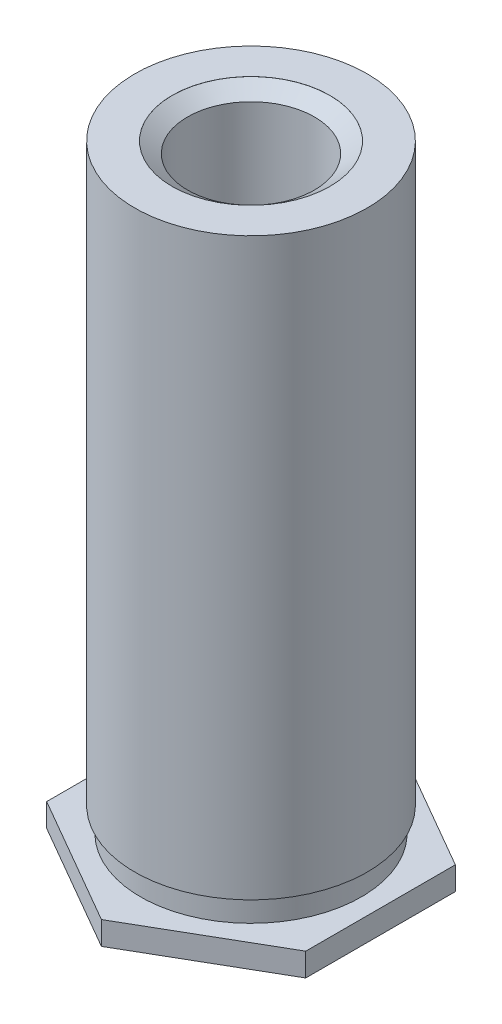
ISO-10303-21;
HEADER;
FILE_DESCRIPTION(('STEP AP214'),'2;1');
FILE_NAME('part.step','',(''),(''),'','','');
FILE_SCHEMA(('AUTOMOTIVE_DESIGN { 1 0 10303 214 1 1 1 1 }'));
ENDSEC;
DATA;
#1=APPLICATION_CONTEXT('core data for automotive mechanical design processes');
#2=APPLICATION_PROTOCOL_DEFINITION('international standard','automotive_design',2000,#1);
#3=PRODUCT_CONTEXT('',#1,'mechanical');
#4=PRODUCT('Part','Part','',(#3));
#5=PRODUCT_RELATED_PRODUCT_CATEGORY('part','',(#4));
#6=PRODUCT_DEFINITION_FORMATION('','',#4);
#7=PRODUCT_DEFINITION_CONTEXT('part definition',#1,'design');
#8=PRODUCT_DEFINITION('design','',#6,#7);
#9=PRODUCT_DEFINITION_SHAPE('','',#8);
#10=(LENGTH_UNIT() NAMED_UNIT(*) SI_UNIT(.MILLI.,.METRE.));
#11=(NAMED_UNIT(*) PLANE_ANGLE_UNIT() SI_UNIT($,.RADIAN.));
#12=(NAMED_UNIT(*) SI_UNIT($,.STERADIAN.) SOLID_ANGLE_UNIT());
#13=UNCERTAINTY_MEASURE_WITH_UNIT(LENGTH_MEASURE(1.E-05),#10,'distance_accuracy_value','');
#14=(GEOMETRIC_REPRESENTATION_CONTEXT(3) GLOBAL_UNCERTAINTY_ASSIGNED_CONTEXT((#13)) GLOBAL_UNIT_ASSIGNED_CONTEXT((#10,
#11,#12)) REPRESENTATION_CONTEXT('',''));
#15=CARTESIAN_POINT('',(0.,0.,0.));
#16=DIRECTION('',(0.,0.,1.));
#17=DIRECTION('',(1.,0.,0.));
#18=AXIS2_PLACEMENT_3D('',#15,#16,#17);
#19=CARTESIAN_POINT('',(4.596384,0.7112,0.));
#20=DIRECTION('',(0.,1.,0.));
#21=DIRECTION('',(0.,0.,1.));
#22=AXIS2_PLACEMENT_3D('',#19,#20,#21);
#23=PLANE('',#22);
#24=CARTESIAN_POINT('',(0.,0.711199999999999,0.));
#25=DIRECTION('',(0.,-1.,0.));
#26=DIRECTION('',(0.,0.,-1.));
#27=AXIS2_PLACEMENT_3D('',#24,#25,#26);
#28=CIRCLE('',#27,3.3782);
#29=CARTESIAN_POINT('',(0.,0.711199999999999,-3.3782));
#30=VERTEX_POINT('',#29);
#31=EDGE_CURVE('E11',#30,#30,#28,.T.);
#32=ORIENTED_EDGE('',*,*,#31,.T.);
#33=EDGE_LOOP('',(#32));
#34=FACE_BOUND('',#33,.T.);
#35=DIRECTION('',(0.866025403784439,0.,0.5));
#36=VECTOR('',#35,1.);
#37=CARTESIAN_POINT('',(0.,0.7112,4.57538541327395));
#38=LINE('',#37,#36);
#39=CARTESIAN_POINT('',(-3.9624,0.7112,2.28769270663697));
#40=VERTEX_POINT('',#39);
#41=CARTESIAN_POINT('',(0.,0.7112,4.57538541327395));
#42=VERTEX_POINT('',#41);
#43=EDGE_CURVE('E140',#40,#42,#38,.T.);
#44=ORIENTED_EDGE('',*,*,#43,.T.);
#45=DIRECTION('',(0.866025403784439,0.,-0.5));
#46=VECTOR('',#45,1.);
#47=CARTESIAN_POINT('',(3.9624,0.7112,2.28769270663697));
#48=LINE('',#47,#46);
#49=CARTESIAN_POINT('',(3.9624,0.7112,2.28769270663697));
#50=VERTEX_POINT('',#49);
#51=EDGE_CURVE('E126',#42,#50,#48,.T.);
#52=ORIENTED_EDGE('',*,*,#51,.T.);
#53=DIRECTION('',(0.,0.,-1.));
#54=VECTOR('',#53,1.);
#55=CARTESIAN_POINT('',(3.9624,0.7112,-2.28769270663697));
#56=LINE('',#55,#54);
#57=CARTESIAN_POINT('',(3.9624,0.7112,-2.28769270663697));
#58=VERTEX_POINT('',#57);
#59=EDGE_CURVE('E128',#50,#58,#56,.T.);
#60=ORIENTED_EDGE('',*,*,#59,.T.);
#61=DIRECTION('',(-0.866025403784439,0.,-0.5));
#62=VECTOR('',#61,1.);
#63=CARTESIAN_POINT('',(0.,0.7112,-4.57538541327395));
#64=LINE('',#63,#62);
#65=CARTESIAN_POINT('',(0.,0.7112,-4.57538541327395));
#66=VERTEX_POINT('',#65);
#67=EDGE_CURVE('E53',#58,#66,#64,.T.);
#68=ORIENTED_EDGE('',*,*,#67,.T.);
#69=DIRECTION('',(-0.866025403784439,0.,0.5));
#70=VECTOR('',#69,1.);
#71=CARTESIAN_POINT('',(-3.9624,0.7112,-2.28769270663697));
#72=LINE('',#71,#70);
#73=CARTESIAN_POINT('',(-3.9624,0.7112,-2.28769270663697));
#74=VERTEX_POINT('',#73);
#75=EDGE_CURVE('E105',#66,#74,#72,.T.);
#76=ORIENTED_EDGE('',*,*,#75,.T.);
#77=DIRECTION('',(0.,0.,1.));
#78=VECTOR('',#77,1.);
#79=CARTESIAN_POINT('',(-3.9624,0.7112,2.28769270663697));
#80=LINE('',#79,#78);
#81=EDGE_CURVE('E131',#74,#40,#80,.T.);
#82=ORIENTED_EDGE('',*,*,#81,.T.);
#83=EDGE_LOOP('',(#44,#52,#60,#68,#76,#82));
#84=FACE_BOUND('',#83,.T.);
#85=ADVANCED_FACE('F39',(#34,#84),#23,.T.);
#86=CARTESIAN_POINT('',(0.,0.,0.));
#87=DIRECTION('',(0.,-1.,0.));
#88=DIRECTION('',(0.,0.,-1.));
#89=AXIS2_PLACEMENT_3D('',#86,#87,#88);
#90=CYLINDRICAL_SURFACE('',#89,3.3782);
#91=CARTESIAN_POINT('',(0.,1.45796,0.));
#92=DIRECTION('',(0.,-1.,0.));
#93=DIRECTION('',(0.,0.,-1.));
#94=AXIS2_PLACEMENT_3D('',#91,#92,#93);
#95=CIRCLE('',#94,3.3782);
#96=CARTESIAN_POINT('',(0.,1.45796,-3.3782));
#97=VERTEX_POINT('',#96);
#98=EDGE_CURVE('E50',#97,#97,#95,.T.);
#99=ORIENTED_EDGE('',*,*,#98,.T.);
#100=EDGE_LOOP('',(#99));
#101=FACE_BOUND('',#100,.T.);
#102=ORIENTED_EDGE('',*,*,#31,.F.);
#103=EDGE_LOOP('',(#102));
#104=FACE_BOUND('',#103,.T.);
#105=ADVANCED_FACE('F171',(#101,#104),#90,.T.);
#106=CARTESIAN_POINT('',(3.556,1.45796,0.));
#107=DIRECTION('',(0.,-1.,0.));
#108=DIRECTION('',(0.,0.,-1.));
#109=AXIS2_PLACEMENT_3D('',#106,#107,#108);
#110=PLANE('',#109);
#111=CARTESIAN_POINT('',(0.,1.45796,0.));
#112=DIRECTION('',(0.,-1.,0.));
#113=DIRECTION('',(0.,0.,-1.));
#114=AXIS2_PLACEMENT_3D('',#111,#112,#113);
#115=CIRCLE('',#114,3.556);
#116=CARTESIAN_POINT('',(0.,1.45796,-3.556));
#117=VERTEX_POINT('',#116);
#118=EDGE_CURVE('E164',#117,#117,#115,.T.);
#119=ORIENTED_EDGE('',*,*,#118,.T.);
#120=EDGE_LOOP('',(#119));
#121=FACE_BOUND('',#120,.T.);
#122=ORIENTED_EDGE('',*,*,#98,.F.);
#123=EDGE_LOOP('',(#122));
#124=FACE_BOUND('',#123,.T.);
#125=ADVANCED_FACE('F172',(#121,#124),#110,.T.);
#126=CARTESIAN_POINT('',(0.,0.,0.));
#127=DIRECTION('',(0.,-1.,0.));
#128=DIRECTION('',(0.,0.,-1.));
#129=AXIS2_PLACEMENT_3D('',#126,#127,#128);
#130=CYLINDRICAL_SURFACE('',#129,3.556);
#131=CARTESIAN_POINT('',(0.,19.05,0.));
#132=DIRECTION('',(0.,-1.,0.));
#133=DIRECTION('',(0.,0.,-1.));
#134=AXIS2_PLACEMENT_3D('',#131,#132,#133);
#135=CIRCLE('',#134,3.556);
#136=CARTESIAN_POINT('',(0.,19.05,-3.556));
#137=VERTEX_POINT('',#136);
#138=EDGE_CURVE('E162',#137,#137,#135,.T.);
#139=ORIENTED_EDGE('',*,*,#138,.T.);
#140=EDGE_LOOP('',(#139));
#141=FACE_BOUND('',#140,.T.);
#142=ORIENTED_EDGE('',*,*,#118,.F.);
#143=EDGE_LOOP('',(#142));
#144=FACE_BOUND('',#143,.T.);
#145=ADVANCED_FACE('F176',(#141,#144),#130,.T.);
#146=CARTESIAN_POINT('',(3.556,19.05,0.));
#147=DIRECTION('',(0.,1.,0.));
#148=DIRECTION('',(0.,0.,1.));
#149=AXIS2_PLACEMENT_3D('',#146,#147,#148);
#150=PLANE('',#149);
#151=CARTESIAN_POINT('',(0.,19.05,0.));
#152=DIRECTION('',(0.,1.,0.));
#153=DIRECTION('',(0.,0.,1.));
#154=AXIS2_PLACEMENT_3D('',#151,#152,#153);
#155=CIRCLE('',#154,2.413);
#156=CARTESIAN_POINT('',(0.,19.05,2.413));
#157=VERTEX_POINT('',#156);
#158=EDGE_CURVE('E45',#157,#157,#155,.T.);
#159=ORIENTED_EDGE('',*,*,#158,.F.);
#160=EDGE_LOOP('',(#159));
#161=FACE_BOUND('',#160,.T.);
#162=ORIENTED_EDGE('',*,*,#138,.F.);
#163=EDGE_LOOP('',(#162));
#164=FACE_BOUND('',#163,.T.);
#165=ADVANCED_FACE('F182',(#161,#164),#150,.T.);
#166=CARTESIAN_POINT('',(0.,-2.54,0.));
#167=DIRECTION('',(0.,-1.,0.));
#168=DIRECTION('',(0.,0.,-1.));
#169=AXIS2_PLACEMENT_3D('',#166,#167,#168);
#170=CYLINDRICAL_SURFACE('',#169,2.413);
#171=ORIENTED_EDGE('',*,*,#158,.T.);
#172=EDGE_LOOP('',(#171));
#173=FACE_BOUND('',#172,.T.);
#174=CARTESIAN_POINT('',(0.,19.04746,0.));
#175=DIRECTION('',(0.,-1.,0.));
#176=DIRECTION('',(0.,0.,-1.));
#177=AXIS2_PLACEMENT_3D('',#174,#175,#176);
#178=CIRCLE('',#177,2.413);
#179=CARTESIAN_POINT('',(0.,19.04746,-2.413));
#180=VERTEX_POINT('',#179);
#181=EDGE_CURVE('E145',#180,#180,#178,.T.);
#182=ORIENTED_EDGE('',*,*,#181,.T.);
#183=EDGE_LOOP('',(#182));
#184=FACE_BOUND('',#183,.T.);
#185=ADVANCED_FACE('F224',(#173,#184),#170,.F.);
#186=CARTESIAN_POINT('',(0.,18.7167768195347,0.));
#187=DIRECTION('',(0.,1.,0.));
#188=DIRECTION('',(0.,0.,1.));
#189=AXIS2_PLACEMENT_3D('',#186,#187,#188);
#190=CONICAL_SURFACE('',#189,1.94056,0.960105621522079);
#191=ORIENTED_EDGE('',*,*,#181,.F.);
#192=EDGE_LOOP('',(#191));
#193=FACE_BOUND('',#192,.T.);
#194=CARTESIAN_POINT('',(0.,18.7167768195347,0.));
#195=DIRECTION('',(0.,-1.,0.));
#196=DIRECTION('',(0.,0.,-1.));
#197=AXIS2_PLACEMENT_3D('',#194,#195,#196);
#198=CIRCLE('',#197,1.94056);
#199=CARTESIAN_POINT('',(0.,18.7167768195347,-1.94056));
#200=VERTEX_POINT('',#199);
#201=EDGE_CURVE('E150',#200,#200,#198,.T.);
#202=ORIENTED_EDGE('',*,*,#201,.T.);
#203=EDGE_LOOP('',(#202));
#204=FACE_BOUND('',#203,.T.);
#205=ADVANCED_FACE('F218',(#193,#204),#190,.F.);
#206=CARTESIAN_POINT('',(0.,4.75879372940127,0.));
#207=DIRECTION('',(0.,1.,0.));
#208=DIRECTION('',(0.,0.,1.));
#209=AXIS2_PLACEMENT_3D('',#206,#207,#208);
#210=CONICAL_SURFACE('',#209,0.,1.17809724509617);
#211=CARTESIAN_POINT('',(0.,5.5626,0.));
#212=DIRECTION('',(0.,-1.,0.));
#213=DIRECTION('',(0.,0.,-1.));
#214=AXIS2_PLACEMENT_3D('',#211,#212,#213);
#215=CIRCLE('',#214,1.94056);
#216=CARTESIAN_POINT('',(0.,5.5626,-1.94056));
#217=VERTEX_POINT('',#216);
#218=EDGE_CURVE('E155',#217,#217,#215,.T.);
#219=ORIENTED_EDGE('',*,*,#218,.F.);
#220=EDGE_LOOP('',(#219));
#221=FACE_BOUND('',#220,.T.);
#222=CARTESIAN_POINT('',(0.,4.75879372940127,0.));
#223=VERTEX_POINT('',#222);
#224=VERTEX_LOOP('',#223);
#225=FACE_BOUND('',#224,.T.);
#226=ADVANCED_FACE('F223',(#221,#225),#210,.F.);
#227=CARTESIAN_POINT('',(0.,0.,0.));
#228=DIRECTION('',(0.,-1.,0.));
#229=DIRECTION('',(0.,0.,-1.));
#230=AXIS2_PLACEMENT_3D('',#227,#228,#229);
#231=CYLINDRICAL_SURFACE('',#230,1.94056);
#232=ORIENTED_EDGE('',*,*,#201,.F.);
#233=EDGE_LOOP('',(#232));
#234=FACE_BOUND('',#233,.T.);
#235=ORIENTED_EDGE('',*,*,#218,.T.);
#236=EDGE_LOOP('',(#235));
#237=FACE_BOUND('',#236,.T.);
#238=ADVANCED_FACE('F216',(#234,#237),#231,.F.);
#239=CARTESIAN_POINT('',(3.9624,0.,2.28769270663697));
#240=DIRECTION('',(0.5,0.,0.866025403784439));
#241=DIRECTION('',(0.866025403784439,0.,-0.5));
#242=AXIS2_PLACEMENT_3D('',#239,#240,#241);
#243=PLANE('',#242);
#244=ORIENTED_EDGE('',*,*,#51,.F.);
#245=DIRECTION('',(0.,1.,0.));
#246=VECTOR('',#245,1.);
#247=CARTESIAN_POINT('',(0.,0.,4.57538541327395));
#248=LINE('',#247,#246);
#249=CARTESIAN_POINT('',(0.,0.,4.57538541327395));
#250=VERTEX_POINT('',#249);
#251=EDGE_CURVE('E136',#250,#42,#248,.T.);
#252=ORIENTED_EDGE('',*,*,#251,.F.);
#253=DIRECTION('',(0.866025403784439,0.,-0.5));
#254=VECTOR('',#253,1.);
#255=CARTESIAN_POINT('',(3.9624,0.,2.28769270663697));
#256=LINE('',#255,#254);
#257=CARTESIAN_POINT('',(3.9624,0.,2.28769270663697));
#258=VERTEX_POINT('',#257);
#259=EDGE_CURVE('E62',#250,#258,#256,.T.);
#260=ORIENTED_EDGE('',*,*,#259,.T.);
#261=DIRECTION('',(0.,1.,0.));
#262=VECTOR('',#261,1.);
#263=CARTESIAN_POINT('',(3.9624,0.,2.28769270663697));
#264=LINE('',#263,#262);
#265=EDGE_CURVE('E123',#258,#50,#264,.T.);
#266=ORIENTED_EDGE('',*,*,#265,.T.);
#267=EDGE_LOOP('',(#244,#252,#260,#266));
#268=FACE_BOUND('',#267,.T.);
#269=ADVANCED_FACE('F196',(#268),#243,.T.);
#270=CARTESIAN_POINT('',(0.,0.,4.57538541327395));
#271=DIRECTION('',(-0.5,0.,0.866025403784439));
#272=DIRECTION('',(0.866025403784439,0.,0.5));
#273=AXIS2_PLACEMENT_3D('',#270,#271,#272);
#274=PLANE('',#273);
#275=ORIENTED_EDGE('',*,*,#43,.F.);
#276=DIRECTION('',(0.,1.,0.));
#277=VECTOR('',#276,1.);
#278=CARTESIAN_POINT('',(-3.9624,0.,2.28769270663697));
#279=LINE('',#278,#277);
#280=CARTESIAN_POINT('',(-3.9624,0.,2.28769270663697));
#281=VERTEX_POINT('',#280);
#282=EDGE_CURVE('E141',#281,#40,#279,.T.);
#283=ORIENTED_EDGE('',*,*,#282,.F.);
#284=DIRECTION('',(0.866025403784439,0.,0.5));
#285=VECTOR('',#284,1.);
#286=CARTESIAN_POINT('',(0.,0.,4.57538541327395));
#287=LINE('',#286,#285);
#288=EDGE_CURVE('E118',#281,#250,#287,.T.);
#289=ORIENTED_EDGE('',*,*,#288,.T.);
#290=ORIENTED_EDGE('',*,*,#251,.T.);
#291=EDGE_LOOP('',(#275,#283,#289,#290));
#292=FACE_BOUND('',#291,.T.);
#293=ADVANCED_FACE('F200',(#292),#274,.T.);
#294=CARTESIAN_POINT('',(-3.9624,0.,2.28769270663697));
#295=DIRECTION('',(-1.,0.,0.));
#296=DIRECTION('',(0.,0.,1.));
#297=AXIS2_PLACEMENT_3D('',#294,#295,#296);
#298=PLANE('',#297);
#299=ORIENTED_EDGE('',*,*,#81,.F.);
#300=DIRECTION('',(0.,1.,0.));
#301=VECTOR('',#300,1.);
#302=CARTESIAN_POINT('',(-3.9624,0.,-2.28769270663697));
#303=LINE('',#302,#301);
#304=CARTESIAN_POINT('',(-3.9624,0.,-2.28769270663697));
#305=VERTEX_POINT('',#304);
#306=EDGE_CURVE('E101',#305,#74,#303,.T.);
#307=ORIENTED_EDGE('',*,*,#306,.F.);
#308=DIRECTION('',(0.,0.,1.));
#309=VECTOR('',#308,1.);
#310=CARTESIAN_POINT('',(-3.9624,0.,2.28769270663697));
#311=LINE('',#310,#309);
#312=EDGE_CURVE('E120',#305,#281,#311,.T.);
#313=ORIENTED_EDGE('',*,*,#312,.T.);
#314=ORIENTED_EDGE('',*,*,#282,.T.);
#315=EDGE_LOOP('',(#299,#307,#313,#314));
#316=FACE_BOUND('',#315,.T.);
#317=ADVANCED_FACE('F312',(#316),#298,.T.);
#318=CARTESIAN_POINT('',(-3.9624,0.,-2.28769270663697));
#319=DIRECTION('',(-0.5,0.,-0.866025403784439));
#320=DIRECTION('',(-0.866025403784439,0.,0.5));
#321=AXIS2_PLACEMENT_3D('',#318,#319,#320);
#322=PLANE('',#321);
#323=ORIENTED_EDGE('',*,*,#75,.F.);
#324=DIRECTION('',(0.,1.,0.));
#325=VECTOR('',#324,1.);
#326=CARTESIAN_POINT('',(0.,0.,-4.57538541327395));
#327=LINE('',#326,#325);
#328=CARTESIAN_POINT('',(0.,0.,-4.57538541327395));
#329=VERTEX_POINT('',#328);
#330=EDGE_CURVE('E91',#329,#66,#327,.T.);
#331=ORIENTED_EDGE('',*,*,#330,.F.);
#332=DIRECTION('',(-0.866025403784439,0.,0.5));
#333=VECTOR('',#332,1.);
#334=CARTESIAN_POINT('',(-3.9624,0.,-2.28769270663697));
#335=LINE('',#334,#333);
#336=EDGE_CURVE('E100',#329,#305,#335,.T.);
#337=ORIENTED_EDGE('',*,*,#336,.T.);
#338=ORIENTED_EDGE('',*,*,#306,.T.);
#339=EDGE_LOOP('',(#323,#331,#337,#338));
#340=FACE_BOUND('',#339,.T.);
#341=ADVANCED_FACE('F97',(#340),#322,.T.);
#342=CARTESIAN_POINT('',(0.,0.,-4.57538541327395));
#343=DIRECTION('',(0.5,0.,-0.866025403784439));
#344=DIRECTION('',(-0.866025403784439,0.,-0.5));
#345=AXIS2_PLACEMENT_3D('',#342,#343,#344);
#346=PLANE('',#345);
#347=ORIENTED_EDGE('',*,*,#67,.F.);
#348=DIRECTION('',(0.,1.,0.));
#349=VECTOR('',#348,1.);
#350=CARTESIAN_POINT('',(3.9624,0.,-2.28769270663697));
#351=LINE('',#350,#349);
#352=CARTESIAN_POINT('',(3.9624,0.,-2.28769270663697));
#353=VERTEX_POINT('',#352);
#354=EDGE_CURVE('E104',#353,#58,#351,.T.);
#355=ORIENTED_EDGE('',*,*,#354,.F.);
#356=DIRECTION('',(-0.866025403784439,0.,-0.5));
#357=VECTOR('',#356,1.);
#358=CARTESIAN_POINT('',(0.,0.,-4.57538541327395));
#359=LINE('',#358,#357);
#360=EDGE_CURVE('E110',#353,#329,#359,.T.);
#361=ORIENTED_EDGE('',*,*,#360,.T.);
#362=ORIENTED_EDGE('',*,*,#330,.T.);
#363=EDGE_LOOP('',(#347,#355,#361,#362));
#364=FACE_BOUND('',#363,.T.);
#365=ADVANCED_FACE('F108',(#364),#346,.T.);
#366=CARTESIAN_POINT('',(3.9624,0.,-2.28769270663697));
#367=DIRECTION('',(1.,0.,0.));
#368=DIRECTION('',(0.,0.,-1.));
#369=AXIS2_PLACEMENT_3D('',#366,#367,#368);
#370=PLANE('',#369);
#371=ORIENTED_EDGE('',*,*,#59,.F.);
#372=ORIENTED_EDGE('',*,*,#265,.F.);
#373=DIRECTION('',(0.,0.,-1.));
#374=VECTOR('',#373,1.);
#375=CARTESIAN_POINT('',(3.9624,0.,-2.28769270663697));
#376=LINE('',#375,#374);
#377=EDGE_CURVE('E115',#258,#353,#376,.T.);
#378=ORIENTED_EDGE('',*,*,#377,.T.);
#379=ORIENTED_EDGE('',*,*,#354,.T.);
#380=EDGE_LOOP('',(#371,#372,#378,#379));
#381=FACE_BOUND('',#380,.T.);
#382=ADVANCED_FACE('F205',(#381),#370,.T.);
#383=CARTESIAN_POINT('',(3.556,0.00253999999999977,0.));
#384=DIRECTION('',(0.,-1.,0.));
#385=DIRECTION('',(0.,0.,-1.));
#386=AXIS2_PLACEMENT_3D('',#383,#384,#385);
#387=PLANE('',#386);
#388=CARTESIAN_POINT('',(0.,0.00253999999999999,0.));
#389=DIRECTION('',(0.,-1.,0.));
#390=DIRECTION('',(0.,0.,-1.));
#391=AXIS2_PLACEMENT_3D('',#388,#389,#390);
#392=CIRCLE('',#391,3.556);
#393=CARTESIAN_POINT('',(0.,0.00253999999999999,-3.556));
#394=VERTEX_POINT('',#393);
#395=EDGE_CURVE('E159',#394,#394,#392,.T.);
#396=ORIENTED_EDGE('',*,*,#395,.T.);
#397=EDGE_LOOP('',(#396));
#398=FACE_BOUND('',#397,.T.);
#399=ADVANCED_FACE('F201',(#398),#387,.T.);
#400=CARTESIAN_POINT('',(0.,0.,0.));
#401=DIRECTION('',(0.,-1.,0.));
#402=DIRECTION('',(0.,0.,-1.));
#403=AXIS2_PLACEMENT_3D('',#400,#401,#402);
#404=CYLINDRICAL_SURFACE('',#403,3.556);
#405=CARTESIAN_POINT('',(0.,0.,0.));
#406=DIRECTION('',(0.,-1.,0.));
#407=DIRECTION('',(0.,0.,-1.));
#408=AXIS2_PLACEMENT_3D('',#405,#406,#407);
#409=CIRCLE('',#408,3.556);
#410=CARTESIAN_POINT('',(0.,0.,-3.556));
#411=VERTEX_POINT('',#410);
#412=EDGE_CURVE('E157',#411,#411,#409,.T.);
#413=ORIENTED_EDGE('',*,*,#412,.T.);
#414=EDGE_LOOP('',(#413));
#415=FACE_BOUND('',#414,.T.);
#416=ORIENTED_EDGE('',*,*,#395,.F.);
#417=EDGE_LOOP('',(#416));
#418=FACE_BOUND('',#417,.T.);
#419=ADVANCED_FACE('F212',(#415,#418),#404,.F.);
#420=CARTESIAN_POINT('',(3.556,0.,0.));
#421=DIRECTION('',(0.,-1.,0.));
#422=DIRECTION('',(0.,0.,-1.));
#423=AXIS2_PLACEMENT_3D('',#420,#421,#422);
#424=PLANE('',#423);
#425=ORIENTED_EDGE('',*,*,#412,.F.);
#426=EDGE_LOOP('',(#425));
#427=FACE_BOUND('',#426,.T.);
#428=ORIENTED_EDGE('',*,*,#377,.F.);
#429=ORIENTED_EDGE('',*,*,#259,.F.);
#430=ORIENTED_EDGE('',*,*,#288,.F.);
#431=ORIENTED_EDGE('',*,*,#312,.F.);
#432=ORIENTED_EDGE('',*,*,#336,.F.);
#433=ORIENTED_EDGE('',*,*,#360,.F.);
#434=EDGE_LOOP('',(#428,#429,#430,#431,#432,#433));
#435=FACE_BOUND('',#434,.T.);
#436=ADVANCED_FACE('F112',(#427,#435),#424,.T.);
#437=CLOSED_SHELL('',(#85,#105,#125,#145,#165,#185,#205,#226,#238,#269,#293,#317,#341,#365,#382,
#399,#419,#436));
#438=MANIFOLD_SOLID_BREP('B2',#437);
#439=ADVANCED_BREP_SHAPE_REPRESENTATION('',(#18,#438),#14);
#440=SHAPE_DEFINITION_REPRESENTATION(#9,#439);
ENDSEC;
END-ISO-10303-21;
